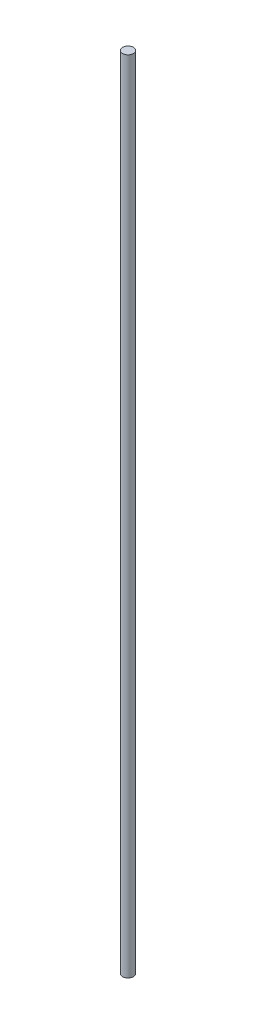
ISO-10303-21;
HEADER;
FILE_DESCRIPTION(('STEP AP214'),'2;1');
FILE_NAME('part.step','',(''),(''),'','','');
FILE_SCHEMA(('AUTOMOTIVE_DESIGN { 1 0 10303 214 1 1 1 1 }'));
ENDSEC;
DATA;
#1=APPLICATION_CONTEXT('core data for automotive mechanical design processes');
#2=APPLICATION_PROTOCOL_DEFINITION('international standard','automotive_design',2000,#1);
#3=PRODUCT_CONTEXT('',#1,'mechanical');
#4=PRODUCT('Part','Part','',(#3));
#5=PRODUCT_RELATED_PRODUCT_CATEGORY('part','',(#4));
#6=PRODUCT_DEFINITION_FORMATION('','',#4);
#7=PRODUCT_DEFINITION_CONTEXT('part definition',#1,'design');
#8=PRODUCT_DEFINITION('design','',#6,#7);
#9=PRODUCT_DEFINITION_SHAPE('','',#8);
#10=(LENGTH_UNIT() NAMED_UNIT(*) SI_UNIT(.MILLI.,.METRE.));
#11=(NAMED_UNIT(*) PLANE_ANGLE_UNIT() SI_UNIT($,.RADIAN.));
#12=(NAMED_UNIT(*) SI_UNIT($,.STERADIAN.) SOLID_ANGLE_UNIT());
#13=UNCERTAINTY_MEASURE_WITH_UNIT(LENGTH_MEASURE(1.E-05),#10,'distance_accuracy_value','');
#14=(GEOMETRIC_REPRESENTATION_CONTEXT(3) GLOBAL_UNCERTAINTY_ASSIGNED_CONTEXT((#13)) GLOBAL_UNIT_ASSIGNED_CONTEXT((#10,
#11,#12)) REPRESENTATION_CONTEXT('',''));
#15=CARTESIAN_POINT('',(0.,0.,0.));
#16=DIRECTION('',(0.,0.,1.));
#17=DIRECTION('',(1.,0.,0.));
#18=AXIS2_PLACEMENT_3D('',#15,#16,#17);
#19=CARTESIAN_POINT('',(0.,92.5,0.));
#20=DIRECTION('',(0.,-1.,0.));
#21=DIRECTION('',(0.,0.,-1.));
#22=AXIS2_PLACEMENT_3D('',#19,#20,#21);
#23=PLANE('',#22);
#24=CARTESIAN_POINT('',(0.,92.5,0.));
#25=DIRECTION('',(0.,1.,0.));
#26=DIRECTION('',(0.,0.,1.));
#27=AXIS2_PLACEMENT_3D('',#24,#25,#26);
#28=CIRCLE('',#27,1.25);
#29=CARTESIAN_POINT('',(0.,92.5,1.25));
#30=VERTEX_POINT('',#29);
#31=EDGE_CURVE('E10',#30,#30,#28,.T.);
#32=ORIENTED_EDGE('',*,*,#31,.T.);
#33=EDGE_LOOP('',(#32));
#34=FACE_BOUND('',#33,.T.);
#35=ADVANCED_FACE('F31',(#34),#23,.F.);
#36=CARTESIAN_POINT('',(0.,66.4223205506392,0.));
#37=DIRECTION('',(0.,1.,0.));
#38=DIRECTION('',(0.,0.,1.));
#39=AXIS2_PLACEMENT_3D('',#36,#37,#38);
#40=CYLINDRICAL_SURFACE('',#39,1.25);
#41=ORIENTED_EDGE('',*,*,#31,.F.);
#42=EDGE_LOOP('',(#41));
#43=FACE_BOUND('',#42,.T.);
#44=CARTESIAN_POINT('',(0.,-92.5,0.));
#45=DIRECTION('',(0.,1.,0.));
#46=DIRECTION('',(0.,0.,1.));
#47=AXIS2_PLACEMENT_3D('',#44,#45,#46);
#48=CIRCLE('',#47,1.25);
#49=CARTESIAN_POINT('',(0.,-92.5,1.25));
#50=VERTEX_POINT('',#49);
#51=EDGE_CURVE('E37',#50,#50,#48,.T.);
#52=ORIENTED_EDGE('',*,*,#51,.T.);
#53=EDGE_LOOP('',(#52));
#54=FACE_BOUND('',#53,.T.);
#55=ADVANCED_FACE('F43',(#43,#54),#40,.T.);
#56=CARTESIAN_POINT('',(0.,-92.5,0.));
#57=DIRECTION('',(0.,1.,0.));
#58=DIRECTION('',(0.,0.,1.));
#59=AXIS2_PLACEMENT_3D('',#56,#57,#58);
#60=PLANE('',#59);
#61=ORIENTED_EDGE('',*,*,#51,.F.);
#62=EDGE_LOOP('',(#61));
#63=FACE_BOUND('',#62,.T.);
#64=ADVANCED_FACE('F45',(#63),#60,.F.);
#65=CLOSED_SHELL('',(#35,#55,#64));
#66=MANIFOLD_SOLID_BREP('B2',#65);
#67=ADVANCED_BREP_SHAPE_REPRESENTATION('',(#18,#66),#14);
#68=SHAPE_DEFINITION_REPRESENTATION(#9,#67);
ENDSEC;
END-ISO-10303-21;
